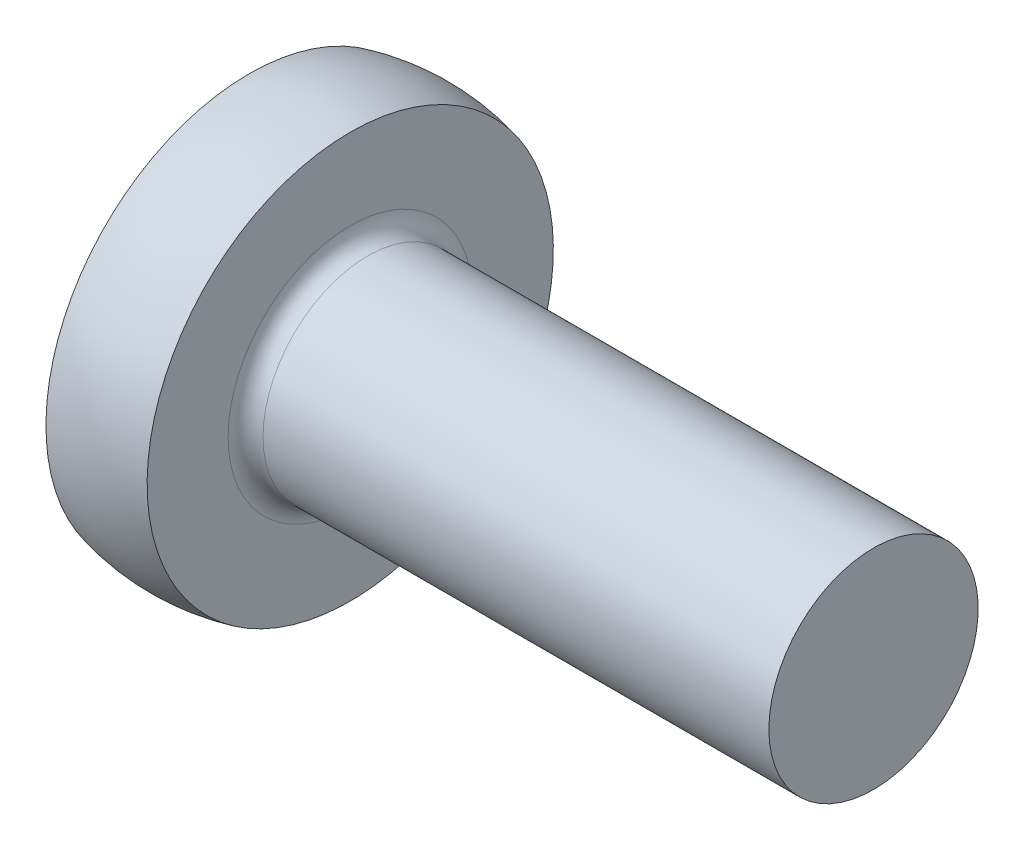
from build123d import *

# Parameters (mm, degrees)
FILLET1_R = 0.1


with BuildPart() as part:
    # Sketch1 → Base-Revolve (revolve)
    with BuildSketch(Plane.XY, mode=Mode.PRIVATE) as base_revolve_sk:
        with BuildLine():
            Line((0, 1.164431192), (0, 0))
            Line((0, 0), (3.58, 0))
            Line((3.58, 0), (3.58, 0.6))
            Line((3.58, 0.6), (0.58, 0.6))
            Line((0.58, 0.6), (0.58, 1.164431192))
            ThreePointArc((0.58, 1.164431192), (0.29, 1.2), (0, 1.164431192))
        make_face()
    revolve(base_revolve_sk.sketch.rotate(Axis((-2.318253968, 0, 0), (1, 0, 0)), 90), axis=Axis((-2.318253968, 0, 0), (1, 0, 0)))

    # Fillet1
    fillet1_edges = [part.edges().sort_by_distance(p)[0] for p in [
        (0.58, 0, -0.6),
    ]]
    fillet(fillet1_edges, radius=FILLET1_R)


solid = part.part
